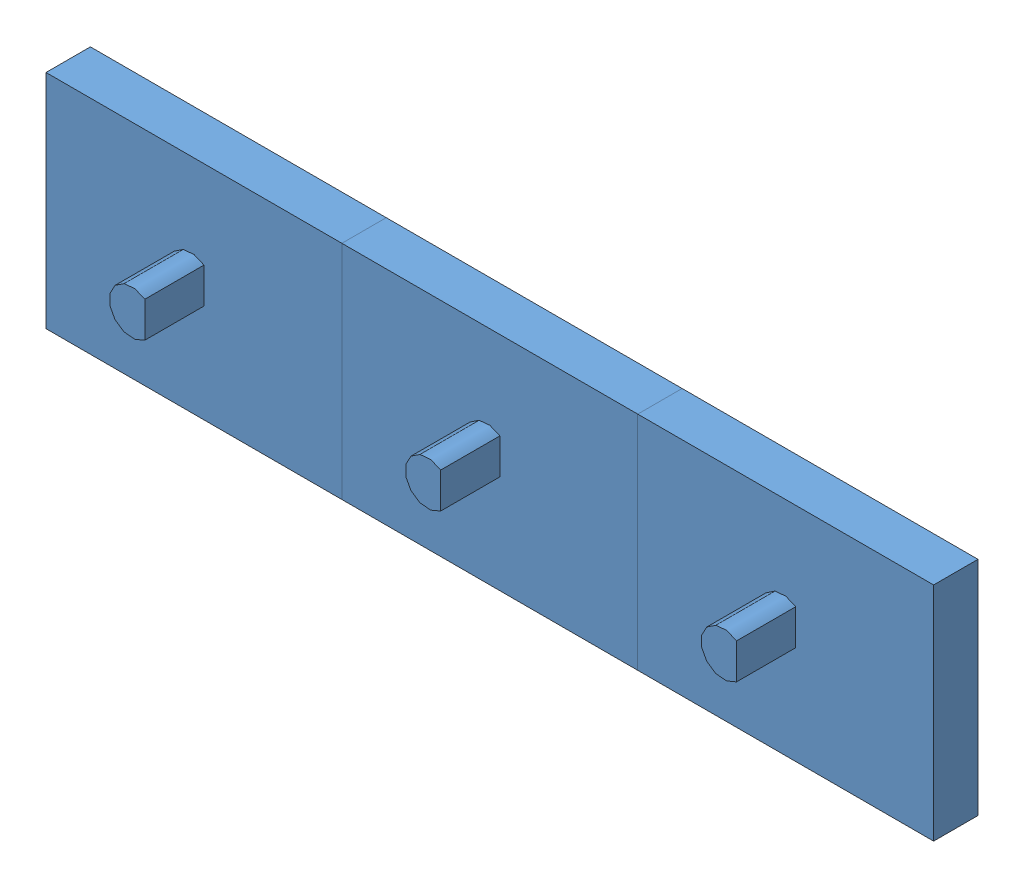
SolidWorks assembly handle display assy.SLDASM, configuration Default (file format 3400). Lengths in mm.
Overall size (300 75 35).
3 component instances, 1 part files, 0 mates.
Components (placement in the parent):
- display board-1: display board.SLDPRT [Default] at origin size (100 75 35)
- display board-4: display board.SLDPRT [Default] at (100 0 0) size (100 75 35)
- display board-5: display board.SLDPRT [Default] at (200 0 0) size (100 75 35)
